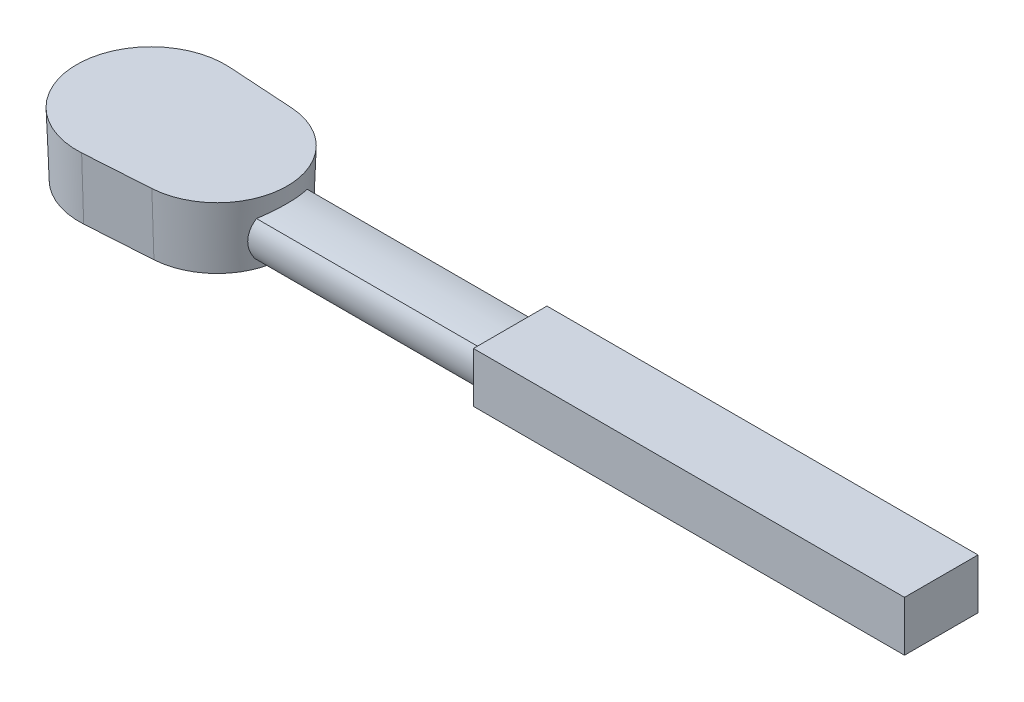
ISO-10303-21;
HEADER;
FILE_DESCRIPTION(('STEP AP214'),'2;1');
FILE_NAME('part.step','',(''),(''),'','','');
FILE_SCHEMA(('AUTOMOTIVE_DESIGN { 1 0 10303 214 1 1 1 1 }'));
ENDSEC;
DATA;
#1=APPLICATION_CONTEXT('core data for automotive mechanical design processes');
#2=APPLICATION_PROTOCOL_DEFINITION('international standard','automotive_design',2000,#1);
#3=PRODUCT_CONTEXT('',#1,'mechanical');
#4=PRODUCT('Part','Part','',(#3));
#5=PRODUCT_RELATED_PRODUCT_CATEGORY('part','',(#4));
#6=PRODUCT_DEFINITION_FORMATION('','',#4);
#7=PRODUCT_DEFINITION_CONTEXT('part definition',#1,'design');
#8=PRODUCT_DEFINITION('design','',#6,#7);
#9=PRODUCT_DEFINITION_SHAPE('','',#8);
#10=(LENGTH_UNIT() NAMED_UNIT(*) SI_UNIT(.MILLI.,.METRE.));
#11=(NAMED_UNIT(*) PLANE_ANGLE_UNIT() SI_UNIT($,.RADIAN.));
#12=(NAMED_UNIT(*) SI_UNIT($,.STERADIAN.) SOLID_ANGLE_UNIT());
#13=UNCERTAINTY_MEASURE_WITH_UNIT(LENGTH_MEASURE(1.E-05),#10,'distance_accuracy_value','');
#14=(GEOMETRIC_REPRESENTATION_CONTEXT(3) GLOBAL_UNCERTAINTY_ASSIGNED_CONTEXT((#13)) GLOBAL_UNIT_ASSIGNED_CONTEXT((#10,
#11,#12)) REPRESENTATION_CONTEXT('',''));
#15=CARTESIAN_POINT('',(0.,0.,0.));
#16=DIRECTION('',(0.,0.,1.));
#17=DIRECTION('',(1.,0.,0.));
#18=AXIS2_PLACEMENT_3D('',#15,#16,#17);
#19=CARTESIAN_POINT('',(46.8650318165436,0.,0.));
#20=DIRECTION('',(0.,1.,0.));
#21=DIRECTION('',(0.,0.,1.));
#22=AXIS2_PLACEMENT_3D('',#19,#20,#21);
#23=CONICAL_SURFACE('',#22,47.9487755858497,0.0349065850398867);
#24=CARTESIAN_POINT('',(46.8650318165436,0.,0.));
#25=DIRECTION('',(0.,1.,0.));
#26=DIRECTION('',(0.,0.,1.));
#27=AXIS2_PLACEMENT_3D('',#24,#25,#26);
#28=CIRCLE('',#27,47.9487755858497);
#29=CARTESIAN_POINT('',(49.9230325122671,0.,47.8511620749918));
#30=VERTEX_POINT('',#29);
#31=CARTESIAN_POINT('',(49.9230325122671,0.,-47.8511620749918));
#32=VERTEX_POINT('',#31);
#33=EDGE_CURVE('E186',#30,#32,#28,.T.);
#34=ORIENTED_EDGE('',*,*,#33,.T.);
#35=DIRECTION('',(0.00222576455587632,0.999390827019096,-0.0348284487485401));
#36=VECTOR('',#35,1.);
#37=CARTESIAN_POINT('',(49.9230325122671,0.,-47.8511620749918));
#38=LINE('',#37,#36);
#39=CARTESIAN_POINT('',(50.0220280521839,44.45,-49.4002302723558));
#40=VERTEX_POINT('',#39);
#41=EDGE_CURVE('E207',#40,#32,#38,.F.);
#42=ORIENTED_EDGE('',*,*,#41,.F.);
#43=CARTESIAN_POINT('',(46.8650318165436,44.45,0.));
#44=DIRECTION('',(0.,1.,0.));
#45=DIRECTION('',(0.,0.,1.));
#46=AXIS2_PLACEMENT_3D('',#43,#44,#45);
#47=CIRCLE('',#46,49.5010037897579);
#48=CARTESIAN_POINT('',(50.0220280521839,44.45,49.4002302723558));
#49=VERTEX_POINT('',#48);
#50=EDGE_CURVE('E195',#49,#40,#47,.T.);
#51=ORIENTED_EDGE('',*,*,#50,.F.);
#52=DIRECTION('',(0.00222576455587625,0.999390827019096,0.0348284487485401));
#53=VECTOR('',#52,1.);
#54=CARTESIAN_POINT('',(49.9230325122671,0.,47.8511620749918));
#55=LINE('',#54,#53);
#56=EDGE_CURVE('E204',#49,#30,#55,.F.);
#57=ORIENTED_EDGE('',*,*,#56,.T.);
#58=EDGE_LOOP('',(#34,#42,#51,#57));
#59=FACE_BOUND('',#58,.T.);
#60=CARTESIAN_POINT('',(92.5218864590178,31.5803299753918,-17.9306892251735));
#61=CARTESIAN_POINT('',(92.7446981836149,31.6948160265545,-17.3742988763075));
#62=CARTESIAN_POINT('',(92.9574742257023,31.8047525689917,-16.8129432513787));
#63=CARTESIAN_POINT('',(93.3624829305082,32.0149720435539,-15.6810533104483));
#64=CARTESIAN_POINT('',(93.5547144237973,32.1152544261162,-15.1105184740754));
#65=CARTESIAN_POINT('',(93.9181994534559,32.3056307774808,-13.9608865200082));
#66=CARTESIAN_POINT('',(94.0894457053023,32.3957212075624,-13.3817865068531));
#67=CARTESIAN_POINT('',(94.4104231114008,32.5651641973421,-12.2161530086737));
#68=CARTESIAN_POINT('',(94.560154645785,32.644516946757,-11.6296196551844));
#69=CARTESIAN_POINT('',(94.9762169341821,32.8656440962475,-9.86114318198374));
#70=CARTESIAN_POINT('',(95.2097884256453,32.990683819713,-8.66914567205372));
#71=CARTESIAN_POINT('',(95.5865391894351,33.1930091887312,-6.26726462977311));
#72=CARTESIAN_POINT('',(95.7297331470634,33.270302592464,-5.05738403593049));
#73=CARTESIAN_POINT('',(95.9243306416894,33.3754596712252,-2.62478852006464));
#74=CARTESIAN_POINT('',(95.9754868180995,33.4031901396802,-1.40204786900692));
#75=CARTESIAN_POINT('',(95.9845777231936,33.40811358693,1.04403805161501));
#76=CARTESIAN_POINT('',(95.9425005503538,33.3853001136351,2.26738337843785));
#77=CARTESIAN_POINT('',(95.7657482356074,33.2897487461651,4.70410999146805));
#78=CARTESIAN_POINT('',(95.6311657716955,33.2170608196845,5.91750002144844));
#79=CARTESIAN_POINT('',(95.2711852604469,33.0235914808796,8.32655869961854));
#80=CARTESIAN_POINT('',(95.0458162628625,32.9028254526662,9.52223288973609));
#81=CARTESIAN_POINT('',(94.635373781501,32.6844318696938,11.3243346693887));
#82=CARTESIAN_POINT('',(94.4822091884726,32.6031669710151,11.9402495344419));
#83=CARTESIAN_POINT('',(94.1522243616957,32.4287908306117,13.1639002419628));
#84=CARTESIAN_POINT('',(93.9754095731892,32.3356823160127,13.7716379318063));
#85=CARTESIAN_POINT('',(93.5989034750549,32.1383317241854,14.977094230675));
#86=CARTESIAN_POINT('',(93.3992473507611,32.034106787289,15.5748266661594));
#87=CARTESIAN_POINT('',(92.9773580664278,31.8150279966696,16.7604180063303));
#88=CARTESIAN_POINT('',(92.7551209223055,31.7001722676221,17.3482751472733));
#89=CARTESIAN_POINT('',(92.5218864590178,31.5803299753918,17.9306892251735));
#90=B_SPLINE_CURVE_WITH_KNOTS('',3,(#60,#61,#62,#63,#64,#65,#66,#67,#68,#69,#70,#71,#72,#73,#74,
#75,#76,#77,#78,#79,#80,#81,#82,#83,#84,#85,#86,#87,#88,#89),.UNSPECIFIED.,.F.,.F.,(4,2,2,2,2,2,
2,2,2,2,2,2,2,2,4),(0.,1.83043841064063,3.66098095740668,5.49215714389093,7.32330097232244,
10.9818467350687,14.639797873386,18.3075655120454,21.9758013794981,25.6403675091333,
29.3037619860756,31.2228268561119,33.141450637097,35.0571577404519,36.9732034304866),.UNSPECIFIED.);
#91=CARTESIAN_POINT('',(92.5219665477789,31.5803711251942,-17.9304892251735));
#92=VERTEX_POINT('',#91);
#93=CARTESIAN_POINT('',(92.5219665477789,31.5803711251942,17.9304892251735));
#94=VERTEX_POINT('',#93);
#95=EDGE_CURVE('E11',#92,#94,#90,.T.);
#96=ORIENTED_EDGE('',*,*,#95,.F.);
#97=CARTESIAN_POINT('',(91.580486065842,6.51942887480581,-17.9303494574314));
#98=CARTESIAN_POINT('',(91.4664358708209,6.98942211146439,-18.2588415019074));
#99=CARTESIAN_POINT('',(91.3561137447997,7.47304459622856,-18.5692745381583));
#100=CARTESIAN_POINT('',(91.1460914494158,8.46515507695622,-19.1521409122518));
#101=CARTESIAN_POINT('',(91.046396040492,8.97365406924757,-19.4245572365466));
#102=CARTESIAN_POINT('',(90.8606486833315,10.014111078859,-19.9298968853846));
#103=CARTESIAN_POINT('',(90.7746345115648,10.5461290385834,-20.1627109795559));
#104=CARTESIAN_POINT('',(90.6196124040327,11.6291094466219,-20.5859398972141));
#105=CARTESIAN_POINT('',(90.5506019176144,12.1800690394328,-20.7763610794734));
#106=CARTESIAN_POINT('',(90.4320478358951,13.2992677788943,-21.1136071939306));
#107=CARTESIAN_POINT('',(90.3825695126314,13.8675581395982,-21.2602855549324));
#108=CARTESIAN_POINT('',(90.3055666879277,15.0155683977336,-21.5076910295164));
#109=CARTESIAN_POINT('',(90.2780430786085,15.5952887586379,-21.6084162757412));
#110=CARTESIAN_POINT('',(90.2464355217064,16.7603022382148,-21.7626840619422));
#111=CARTESIAN_POINT('',(90.2422994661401,17.3455800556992,-21.8163312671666));
#112=CARTESIAN_POINT('',(90.2579281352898,18.5182123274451,-21.8763449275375));
#113=CARTESIAN_POINT('',(90.2776914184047,19.1055666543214,-21.8827142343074));
#114=CARTESIAN_POINT('',(90.3390752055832,20.2452787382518,-21.8492763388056));
#115=CARTESIAN_POINT('',(90.379431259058,20.7977814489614,-21.811994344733));
#116=CARTESIAN_POINT('',(90.4802558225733,21.8965421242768,-21.6959677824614));
#117=CARTESIAN_POINT('',(90.540724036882,22.4428001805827,-21.6172238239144));
#118=CARTESIAN_POINT('',(90.6803623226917,23.5265449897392,-21.4190862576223));
#119=CARTESIAN_POINT('',(90.7595684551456,24.0640126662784,-21.299614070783));
#120=CARTESIAN_POINT('',(90.9345876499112,25.1258666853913,-21.021363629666));
#121=CARTESIAN_POINT('',(91.0304001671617,25.6502534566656,-20.8625866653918));
#122=CARTESIAN_POINT('',(91.2300029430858,26.6517461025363,-20.5180232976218));
#123=CARTESIAN_POINT('',(91.3329549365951,27.129788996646,-20.3344637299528));
#124=CARTESIAN_POINT('',(91.5492849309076,28.0698630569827,-19.9352826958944));
#125=CARTESIAN_POINT('',(91.6626632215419,28.5318937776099,-19.719660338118));
#126=CARTESIAN_POINT('',(91.8971598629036,29.436372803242,-19.2585715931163));
#127=CARTESIAN_POINT('',(92.0182465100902,29.8788900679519,-19.0132241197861));
#128=CARTESIAN_POINT('',(92.2662889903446,30.744588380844,-18.4933552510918));
#129=CARTESIAN_POINT('',(92.3932434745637,31.1677738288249,-18.218840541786));
#130=CARTESIAN_POINT('',(92.5220289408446,31.5805711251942,-17.9303494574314));
#131=B_SPLINE_CURVE_WITH_KNOTS('',3,(#97,#98,#99,#100,#101,#102,#103,#104,#105,#106,#107,#108,
#109,#110,#111,#112,#113,#114,#115,#116,#117,#118,#119,#120,#121,#122,#123,#124,#125,#126,#127,
#128,#129,#130),.UNSPECIFIED.,.F.,.F.,(4,2,2,2,2,2,2,2,2,2,2,2,2,2,2,2,4),(0.,1.75361022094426,
3.50800273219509,5.26715836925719,7.02604996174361,8.79077059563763,10.5555629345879,
12.3164217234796,14.0771743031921,15.7409009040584,17.4046030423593,19.0715333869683,
20.7384090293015,22.3040206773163,23.8696758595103,25.4292626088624,26.9884926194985),.UNSPECIFIED.);
#132=CARTESIAN_POINT('',(91.580437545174,6.5196288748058,-17.9304892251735));
#133=VERTEX_POINT('',#132);
#134=EDGE_CURVE('E203',#133,#92,#131,.T.);
#135=ORIENTED_EDGE('',*,*,#134,.F.);
#136=CARTESIAN_POINT('',(91.5803588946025,6.51967002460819,17.9306892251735));
#137=CARTESIAN_POINT('',(91.8024305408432,6.4034773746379,17.3660063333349));
#138=CARTESIAN_POINT('',(92.0143136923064,6.2919975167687,16.7963372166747));
#139=CARTESIAN_POINT('',(92.4172451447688,6.07902564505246,15.6478037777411));
#140=CARTESIAN_POINT('',(92.6082923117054,5.97753417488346,15.0689389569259));
#141=CARTESIAN_POINT('',(92.9691291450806,5.78508238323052,13.9026607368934));
#142=CARTESIAN_POINT('',(93.1389117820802,5.69412554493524,13.3152445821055));
#143=CARTESIAN_POINT('',(93.4567013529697,5.5232952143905,12.1330096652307));
#144=CARTESIAN_POINT('',(93.6047086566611,5.44342153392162,11.5381910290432));
#145=CARTESIAN_POINT('',(94.0152625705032,5.22123771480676,9.74481734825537));
#146=CARTESIAN_POINT('',(94.2446709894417,5.09618795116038,8.53628012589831));
#147=CARTESIAN_POINT('',(94.6122071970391,4.89523261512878,6.10168674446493));
#148=CARTESIAN_POINT('',(94.750349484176,4.81931923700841,4.87563339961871));
#149=CARTESIAN_POINT('',(94.9340322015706,4.71827987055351,2.41130284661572));
#150=CARTESIAN_POINT('',(94.9793346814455,4.69328438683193,1.17300238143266));
#151=CARTESIAN_POINT('',(94.9760410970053,4.69509967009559,-1.30359860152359));
#152=CARTESIAN_POINT('',(94.9274326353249,4.72191727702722,-2.54189909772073));
#153=CARTESIAN_POINT('',(94.7370245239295,4.82664112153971,-5.00769563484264));
#154=CARTESIAN_POINT('',(94.5953277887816,4.90449093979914,-6.23520209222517));
#155=CARTESIAN_POINT('',(94.2205662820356,5.1093347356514,-8.67172178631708));
#156=CARTESIAN_POINT('',(93.9875326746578,5.2363119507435,-9.88074118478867));
#157=CARTESIAN_POINT('',(93.5741665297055,5.45991184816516,-11.6630037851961));
#158=CARTESIAN_POINT('',(93.4274233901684,5.5390663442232,-12.2464952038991));
#159=CARTESIAN_POINT('',(93.1130129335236,5.70800877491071,-13.4061474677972));
#160=CARTESIAN_POINT('',(92.9453505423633,5.79779420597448,-13.9823100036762));
#161=CARTESIAN_POINT('',(92.5897687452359,5.98738038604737,-15.1256651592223));
#162=CARTESIAN_POINT('',(92.4018809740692,6.08716547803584,-15.6928702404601));
#163=CARTESIAN_POINT('',(92.00604879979,6.29634596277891,-16.818545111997));
#164=CARTESIAN_POINT('',(91.7981012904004,6.4057428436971,-17.3770135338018));
#165=CARTESIAN_POINT('',(91.5803588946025,6.51967002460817,-17.9306892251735));
#166=B_SPLINE_CURVE_WITH_KNOTS('',3,(#136,#137,#138,#139,#140,#141,#142,#143,#144,#145,#146,
#147,#148,#149,#150,#151,#152,#153,#154,#155,#156,#157,#158,#159,#160,#161,#162,#163,#164,#165),
.UNSPECIFIED.,.F.,.F.,(4,2,2,2,2,2,2,2,2,2,2,2,2,2,4),(0.,1.85330428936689,3.70670940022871,
5.5607255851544,7.41471028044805,11.1193053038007,14.8233116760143,18.5367996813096,
22.2507779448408,25.9606570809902,29.6692715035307,31.4894042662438,33.3091092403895,
35.1260082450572,36.9431890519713),.UNSPECIFIED.);
#167=CARTESIAN_POINT('',(91.580437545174,6.51962887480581,17.9304892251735));
#168=VERTEX_POINT('',#167);
#169=EDGE_CURVE('E48',#168,#133,#166,.T.);
#170=ORIENTED_EDGE('',*,*,#169,.F.);
#171=CARTESIAN_POINT('',(92.5220289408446,31.5805711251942,17.9303494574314));
#172=CARTESIAN_POINT('',(92.3724548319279,31.1011614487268,18.2654024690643));
#173=CARTESIAN_POINT('',(92.2253521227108,30.6077132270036,18.5816089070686));
#174=CARTESIAN_POINT('',(91.9395171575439,29.5949798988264,19.174470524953));
#175=CARTESIAN_POINT('',(91.8007888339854,29.0756828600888,19.4511072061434));
#176=CARTESIAN_POINT('',(91.5347193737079,28.0117168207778,19.9637280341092));
#177=CARTESIAN_POINT('',(91.4074284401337,27.4669505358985,20.1995368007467));
#178=CARTESIAN_POINT('',(91.1683589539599,26.3571156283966,20.6269781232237));
#179=CARTESIAN_POINT('',(91.0565781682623,25.7920499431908,20.8186170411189));
#180=CARTESIAN_POINT('',(90.8513690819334,24.6429554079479,21.1563543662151));
#181=CARTESIAN_POINT('',(90.7580065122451,24.0588670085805,21.3022907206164));
#182=CARTESIAN_POINT('',(90.5929650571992,22.8776365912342,21.5458922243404));
#183=CARTESIAN_POINT('',(90.5212869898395,22.2804940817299,21.6435555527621));
#184=CARTESIAN_POINT('',(90.4019952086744,21.0793893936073,21.7889691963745));
#185=CARTESIAN_POINT('',(90.3543178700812,20.4754496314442,21.8368518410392));
#186=CARTESIAN_POINT('',(90.2841230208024,19.2642448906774,21.8822741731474));
#187=CARTESIAN_POINT('',(90.2616032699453,18.6569802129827,21.8798183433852));
#188=CARTESIAN_POINT('',(90.2428114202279,17.4876632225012,21.8263485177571));
#189=CARTESIAN_POINT('',(90.2447812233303,16.9254764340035,21.7788115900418));
#190=CARTESIAN_POINT('',(90.2702864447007,15.8069431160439,21.6405349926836));
#191=CARTESIAN_POINT('',(90.2938215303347,15.2505964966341,21.5497959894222));
#192=CARTESIAN_POINT('',(90.3613335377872,14.1468333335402,21.3257897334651));
#193=CARTESIAN_POINT('',(90.4053452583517,13.5994336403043,21.1924502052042));
#194=CARTESIAN_POINT('',(90.5120101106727,12.5182669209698,20.8845634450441));
#195=CARTESIAN_POINT('',(90.5746616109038,11.9844987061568,20.7100198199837));
#196=CARTESIAN_POINT('',(90.704852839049,11.0187873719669,20.3527121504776));
#197=CARTESIAN_POINT('',(90.769968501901,10.5843228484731,20.1758295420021));
#198=CARTESIAN_POINT('',(90.9101426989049,9.7289694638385,19.7952050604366));
#199=CARTESIAN_POINT('',(90.9852012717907,9.30808065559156,19.5914630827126));
#200=CARTESIAN_POINT('',(91.1433238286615,8.48294284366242,19.1589698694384));
#201=CARTESIAN_POINT('',(91.2263577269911,8.07863892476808,18.9303122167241));
#202=CARTESIAN_POINT('',(91.3989511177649,7.28642214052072,18.4484669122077));
#203=CARTESIAN_POINT('',(91.4885099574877,6.89850764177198,18.1952817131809));
#204=CARTESIAN_POINT('',(91.580486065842,6.51942887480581,17.9303494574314));
#205=B_SPLINE_CURVE_WITH_KNOTS('',3,(#171,#172,#173,#174,#175,#176,#177,#178,#179,#180,#181,
#182,#183,#184,#185,#186,#187,#188,#189,#190,#191,#192,#193,#194,#195,#196,#197,#198,#199,#200,
#201,#202,#203,#204),.UNSPECIFIED.,.F.,.F.,(4,2,2,2,2,2,2,2,2,2,2,2,2,2,2,2,4),(0.,
1.81078883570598,3.6224214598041,5.44165280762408,7.26062195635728,9.08596965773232,
10.9113862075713,12.7319378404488,14.5523273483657,16.2428342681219,17.933315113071,
19.6266793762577,21.3198954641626,22.7396218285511,24.159353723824,25.5739258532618,
26.9883566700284),.UNSPECIFIED.);
#206=EDGE_CURVE('E38',#94,#168,#205,.T.);
#207=ORIENTED_EDGE('',*,*,#206,.F.);
#208=EDGE_LOOP('',(#96,#135,#170,#207));
#209=FACE_BOUND('',#208,.T.);
#210=ADVANCED_FACE('F26',(#59,#209),#23,.T.);
#211=CARTESIAN_POINT('',(0.,0.,0.));
#212=DIRECTION('',(0.,1.,0.));
#213=DIRECTION('',(0.,0.,1.));
#214=AXIS2_PLACEMENT_3D('',#211,#212,#213);
#215=CONICAL_SURFACE('',#214,50.9376589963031,0.0349065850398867);
#216=CARTESIAN_POINT('',(0.,0.,0.));
#217=DIRECTION('',(0.,1.,0.));
#218=DIRECTION('',(0.,0.,1.));
#219=AXIS2_PLACEMENT_3D('',#216,#217,#218);
#220=CIRCLE('',#219,50.9376589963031);
#221=CARTESIAN_POINT('',(3.24862094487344,0.,-50.8339607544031));
#222=VERTEX_POINT('',#221);
#223=CARTESIAN_POINT('',(3.24862094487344,0.,50.8339607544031));
#224=VERTEX_POINT('',#223);
#225=EDGE_CURVE('E181',#222,#224,#220,.T.);
#226=ORIENTED_EDGE('',*,*,#225,.T.);
#227=DIRECTION('',(0.00222576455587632,0.999390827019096,0.0348284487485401));
#228=VECTOR('',#227,1.);
#229=CARTESIAN_POINT('',(3.24862094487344,0.,50.8339607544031));
#230=LINE('',#229,#228);
#231=CARTESIAN_POINT('',(3.34761648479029,44.45,52.3830289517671));
#232=VERTEX_POINT('',#231);
#233=EDGE_CURVE('E200',#232,#224,#230,.F.);
#234=ORIENTED_EDGE('',*,*,#233,.F.);
#235=CARTESIAN_POINT('',(0.,44.45,0.));
#236=DIRECTION('',(0.,1.,0.));
#237=DIRECTION('',(0.,0.,1.));
#238=AXIS2_PLACEMENT_3D('',#235,#236,#237);
#239=CIRCLE('',#238,52.4898872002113);
#240=CARTESIAN_POINT('',(3.34761648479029,44.45,-52.3830289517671));
#241=VERTEX_POINT('',#240);
#242=EDGE_CURVE('E190',#241,#232,#239,.T.);
#243=ORIENTED_EDGE('',*,*,#242,.F.);
#244=DIRECTION('',(0.00222576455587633,0.999390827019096,-0.0348284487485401));
#245=VECTOR('',#244,1.);
#246=CARTESIAN_POINT('',(3.24862094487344,0.,-50.8339607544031));
#247=LINE('',#246,#245);
#248=EDGE_CURVE('E199',#241,#222,#247,.F.);
#249=ORIENTED_EDGE('',*,*,#248,.T.);
#250=EDGE_LOOP('',(#226,#234,#243,#249));
#251=FACE_BOUND('',#250,.T.);
#252=ADVANCED_FACE('F251',(#251),#215,.T.);
#253=CARTESIAN_POINT('',(3.24862094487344,0.,50.8339607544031));
#254=DIRECTION('',(0.0637375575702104,-0.034899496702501,0.997356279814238));
#255=DIRECTION('',(0.997964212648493,0.,-0.0637764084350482));
#256=AXIS2_PLACEMENT_3D('',#253,#254,#255);
#257=PLANE('',#256);
#258=DIRECTION('',(0.997964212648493,0.,-0.0637764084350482));
#259=VECTOR('',#258,1.);
#260=CARTESIAN_POINT('',(3.24862094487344,0.,50.8339607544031));
#261=LINE('',#260,#259);
#262=EDGE_CURVE('E184',#224,#30,#261,.T.);
#263=ORIENTED_EDGE('',*,*,#262,.T.);
#264=ORIENTED_EDGE('',*,*,#56,.F.);
#265=DIRECTION('',(-0.997964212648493,0.,0.0637764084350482));
#266=VECTOR('',#265,1.);
#267=CARTESIAN_POINT('',(3.34761648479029,44.45,52.3830289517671));
#268=LINE('',#267,#266);
#269=EDGE_CURVE('E193',#232,#49,#268,.F.);
#270=ORIENTED_EDGE('',*,*,#269,.F.);
#271=ORIENTED_EDGE('',*,*,#233,.T.);
#272=EDGE_LOOP('',(#263,#264,#270,#271));
#273=FACE_BOUND('',#272,.T.);
#274=ADVANCED_FACE('F28',(#273),#257,.T.);
#275=CARTESIAN_POINT('',(3.24862094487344,0.,-50.8339607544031));
#276=DIRECTION('',(0.0637375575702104,-0.034899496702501,-0.997356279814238));
#277=DIRECTION('',(-0.997964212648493,0.,-0.0637764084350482));
#278=AXIS2_PLACEMENT_3D('',#275,#276,#277);
#279=PLANE('',#278);
#280=DIRECTION('',(-0.997964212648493,0.,-0.0637764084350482));
#281=VECTOR('',#280,1.);
#282=CARTESIAN_POINT('',(3.24862094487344,0.,-50.8339607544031));
#283=LINE('',#282,#281);
#284=EDGE_CURVE('E188',#32,#222,#283,.T.);
#285=ORIENTED_EDGE('',*,*,#284,.T.);
#286=ORIENTED_EDGE('',*,*,#248,.F.);
#287=DIRECTION('',(0.997964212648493,0.,0.0637764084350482));
#288=VECTOR('',#287,1.);
#289=CARTESIAN_POINT('',(3.34761648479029,44.45,-52.3830289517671));
#290=LINE('',#289,#288);
#291=EDGE_CURVE('E197',#40,#241,#290,.F.);
#292=ORIENTED_EDGE('',*,*,#291,.F.);
#293=ORIENTED_EDGE('',*,*,#41,.T.);
#294=EDGE_LOOP('',(#285,#286,#292,#293));
#295=FACE_BOUND('',#294,.T.);
#296=ADVANCED_FACE('F268',(#295),#279,.T.);
#297=CARTESIAN_POINT('',(0.,44.45,0.));
#298=DIRECTION('',(0.,1.,0.));
#299=DIRECTION('',(0.,0.,1.));
#300=AXIS2_PLACEMENT_3D('',#297,#298,#299);
#301=PLANE('',#300);
#302=ORIENTED_EDGE('',*,*,#242,.T.);
#303=ORIENTED_EDGE('',*,*,#269,.T.);
#304=ORIENTED_EDGE('',*,*,#50,.T.);
#305=ORIENTED_EDGE('',*,*,#291,.T.);
#306=EDGE_LOOP('',(#302,#303,#304,#305));
#307=FACE_BOUND('',#306,.T.);
#308=ADVANCED_FACE('F275',(#307),#301,.T.);
#309=CARTESIAN_POINT('',(0.,0.,0.));
#310=DIRECTION('',(0.,1.,0.));
#311=DIRECTION('',(0.,0.,1.));
#312=AXIS2_PLACEMENT_3D('',#309,#310,#311);
#313=PLANE('',#312);
#314=ORIENTED_EDGE('',*,*,#225,.F.);
#315=ORIENTED_EDGE('',*,*,#284,.F.);
#316=ORIENTED_EDGE('',*,*,#33,.F.);
#317=ORIENTED_EDGE('',*,*,#262,.F.);
#318=EDGE_LOOP('',(#314,#315,#316,#317));
#319=FACE_BOUND('',#318,.T.);
#320=ADVANCED_FACE('F271',(#319),#313,.F.);
#321=CARTESIAN_POINT('',(254.,-55.5675247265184,0.));
#322=DIRECTION('',(-1.,0.,0.));
#323=DIRECTION('',(0.,0.,1.));
#324=AXIS2_PLACEMENT_3D('',#321,#322,#323);
#325=CYLINDRICAL_SURFACE('',#324,88.9733566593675);
#326=DIRECTION('',(-1.,0.,0.));
#327=VECTOR('',#326,1.);
#328=CARTESIAN_POINT('',(254.,31.5803711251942,-17.9304892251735));
#329=LINE('',#328,#327);
#330=CARTESIAN_POINT('',(254.,31.5803711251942,-17.9304892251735));
#331=VERTEX_POINT('',#330);
#332=EDGE_CURVE('E169',#331,#92,#329,.T.);
#333=ORIENTED_EDGE('',*,*,#332,.T.);
#334=ORIENTED_EDGE('',*,*,#95,.T.);
#335=DIRECTION('',(-1.,0.,0.));
#336=VECTOR('',#335,1.);
#337=CARTESIAN_POINT('',(254.,31.5803711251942,17.9304892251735));
#338=LINE('',#337,#336);
#339=CARTESIAN_POINT('',(254.,31.5803711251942,17.9304892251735));
#340=VERTEX_POINT('',#339);
#341=EDGE_CURVE('E178',#340,#94,#338,.T.);
#342=ORIENTED_EDGE('',*,*,#341,.F.);
#343=CARTESIAN_POINT('',(254.,-55.5675247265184,0.));
#344=DIRECTION('',(1.,0.,0.));
#345=DIRECTION('',(0.,0.,1.));
#346=AXIS2_PLACEMENT_3D('',#343,#344,#345);
#347=CIRCLE('',#346,88.9733566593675);
#348=EDGE_CURVE('E134',#331,#340,#347,.T.);
#349=ORIENTED_EDGE('',*,*,#348,.F.);
#350=EDGE_LOOP('',(#333,#334,#342,#349));
#351=FACE_BOUND('',#350,.T.);
#352=ADVANCED_FACE('F238',(#351),#325,.T.);
#353=CARTESIAN_POINT('',(254.,19.05,0.));
#354=DIRECTION('',(-1.,0.,0.));
#355=DIRECTION('',(0.,0.,1.));
#356=AXIS2_PLACEMENT_3D('',#353,#354,#355);
#357=CYLINDRICAL_SURFACE('',#356,21.8749318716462);
#358=ORIENTED_EDGE('',*,*,#341,.T.);
#359=ORIENTED_EDGE('',*,*,#206,.T.);
#360=DIRECTION('',(-1.,0.,0.));
#361=VECTOR('',#360,1.);
#362=CARTESIAN_POINT('',(254.,6.51962887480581,17.9304892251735));
#363=LINE('',#362,#361);
#364=CARTESIAN_POINT('',(254.,6.51962887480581,17.9304892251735));
#365=VERTEX_POINT('',#364);
#366=EDGE_CURVE('E175',#365,#168,#363,.T.);
#367=ORIENTED_EDGE('',*,*,#366,.F.);
#368=CARTESIAN_POINT('',(254.,19.05,0.));
#369=DIRECTION('',(1.,0.,0.));
#370=DIRECTION('',(0.,0.,-1.));
#371=AXIS2_PLACEMENT_3D('',#368,#369,#370);
#372=CIRCLE('',#371,21.8749318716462);
#373=EDGE_CURVE('E160',#340,#365,#372,.T.);
#374=ORIENTED_EDGE('',*,*,#373,.F.);
#375=EDGE_LOOP('',(#358,#359,#367,#374));
#376=FACE_BOUND('',#375,.T.);
#377=ADVANCED_FACE('F234',(#376),#357,.T.);
#378=CARTESIAN_POINT('',(254.,93.6675247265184,0.));
#379=DIRECTION('',(-1.,0.,0.));
#380=DIRECTION('',(0.,0.,1.));
#381=AXIS2_PLACEMENT_3D('',#378,#379,#380);
#382=CYLINDRICAL_SURFACE('',#381,88.9733566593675);
#383=ORIENTED_EDGE('',*,*,#366,.T.);
#384=ORIENTED_EDGE('',*,*,#169,.T.);
#385=DIRECTION('',(-1.,0.,0.));
#386=VECTOR('',#385,1.);
#387=CARTESIAN_POINT('',(254.,6.51962887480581,-17.9304892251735));
#388=LINE('',#387,#386);
#389=CARTESIAN_POINT('',(254.,6.51962887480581,-17.9304892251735));
#390=VERTEX_POINT('',#389);
#391=EDGE_CURVE('E172',#390,#133,#388,.T.);
#392=ORIENTED_EDGE('',*,*,#391,.F.);
#393=CARTESIAN_POINT('',(254.,93.6675247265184,0.));
#394=DIRECTION('',(1.,0.,0.));
#395=DIRECTION('',(0.,0.,-1.));
#396=AXIS2_PLACEMENT_3D('',#393,#394,#395);
#397=CIRCLE('',#396,88.9733566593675);
#398=EDGE_CURVE('E163',#365,#390,#397,.T.);
#399=ORIENTED_EDGE('',*,*,#398,.F.);
#400=EDGE_LOOP('',(#383,#384,#392,#399));
#401=FACE_BOUND('',#400,.T.);
#402=ADVANCED_FACE('F228',(#401),#382,.T.);
#403=CARTESIAN_POINT('',(254.,19.05,0.));
#404=DIRECTION('',(-1.,0.,0.));
#405=DIRECTION('',(0.,0.,1.));
#406=AXIS2_PLACEMENT_3D('',#403,#404,#405);
#407=CYLINDRICAL_SURFACE('',#406,21.8749318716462);
#408=ORIENTED_EDGE('',*,*,#391,.T.);
#409=ORIENTED_EDGE('',*,*,#134,.T.);
#410=ORIENTED_EDGE('',*,*,#332,.F.);
#411=CARTESIAN_POINT('',(254.,19.05,0.));
#412=DIRECTION('',(1.,0.,0.));
#413=DIRECTION('',(0.,0.,-1.));
#414=AXIS2_PLACEMENT_3D('',#411,#412,#413);
#415=CIRCLE('',#414,21.8749318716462);
#416=EDGE_CURVE('E166',#390,#331,#415,.T.);
#417=ORIENTED_EDGE('',*,*,#416,.F.);
#418=EDGE_LOOP('',(#408,#409,#410,#417));
#419=FACE_BOUND('',#418,.T.);
#420=ADVANCED_FACE('F224',(#419),#407,.T.);
#421=CARTESIAN_POINT('',(254.,1.31685435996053,25.9873125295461));
#422=DIRECTION('',(1.,0.,0.));
#423=DIRECTION('',(0.,0.,-1.));
#424=AXIS2_PLACEMENT_3D('',#421,#422,#423);
#425=PLANE('',#424);
#426=DIRECTION('',(0.,-1.,0.));
#427=VECTOR('',#426,1.);
#428=CARTESIAN_POINT('',(254.,36.7831456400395,25.9873125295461));
#429=LINE('',#428,#427);
#430=CARTESIAN_POINT('',(254.,36.7831456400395,25.9873125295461));
#431=VERTEX_POINT('',#430);
#432=CARTESIAN_POINT('',(254.,1.31685435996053,25.9873125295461));
#433=VERTEX_POINT('',#432);
#434=EDGE_CURVE('E121',#431,#433,#429,.T.);
#435=ORIENTED_EDGE('',*,*,#434,.F.);
#436=DIRECTION('',(0.,0.,1.));
#437=VECTOR('',#436,1.);
#438=CARTESIAN_POINT('',(254.,36.7831456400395,25.9873125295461));
#439=LINE('',#438,#437);
#440=CARTESIAN_POINT('',(254.,36.7831456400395,-25.9873125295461));
#441=VERTEX_POINT('',#440);
#442=EDGE_CURVE('E144',#441,#431,#439,.T.);
#443=ORIENTED_EDGE('',*,*,#442,.F.);
#444=DIRECTION('',(0.,1.,0.));
#445=VECTOR('',#444,1.);
#446=CARTESIAN_POINT('',(254.,36.7831456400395,-25.9873125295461));
#447=LINE('',#446,#445);
#448=CARTESIAN_POINT('',(254.,1.31685435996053,-25.9873125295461));
#449=VERTEX_POINT('',#448);
#450=EDGE_CURVE('E122',#449,#441,#447,.T.);
#451=ORIENTED_EDGE('',*,*,#450,.F.);
#452=DIRECTION('',(0.,0.,-1.));
#453=VECTOR('',#452,1.);
#454=CARTESIAN_POINT('',(254.,1.31685435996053,25.9873125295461));
#455=LINE('',#454,#453);
#456=EDGE_CURVE('E115',#433,#449,#455,.T.);
#457=ORIENTED_EDGE('',*,*,#456,.F.);
#458=EDGE_LOOP('',(#435,#443,#451,#457));
#459=FACE_BOUND('',#458,.T.);
#460=ORIENTED_EDGE('',*,*,#416,.T.);
#461=ORIENTED_EDGE('',*,*,#348,.T.);
#462=ORIENTED_EDGE('',*,*,#373,.T.);
#463=ORIENTED_EDGE('',*,*,#398,.T.);
#464=EDGE_LOOP('',(#460,#461,#462,#463));
#465=FACE_BOUND('',#464,.T.);
#466=ADVANCED_FACE('F117',(#459,#465),#425,.F.);
#467=CARTESIAN_POINT('',(558.8,36.7831456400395,25.9873125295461));
#468=DIRECTION('',(0.,0.,-1.));
#469=DIRECTION('',(-1.,0.,0.));
#470=AXIS2_PLACEMENT_3D('',#467,#468,#469);
#471=PLANE('',#470);
#472=ORIENTED_EDGE('',*,*,#434,.T.);
#473=DIRECTION('',(-1.,0.,0.));
#474=VECTOR('',#473,1.);
#475=CARTESIAN_POINT('',(558.8,1.31685435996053,25.9873125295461));
#476=LINE('',#475,#474);
#477=CARTESIAN_POINT('',(558.8,1.31685435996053,25.9873125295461));
#478=VERTEX_POINT('',#477);
#479=EDGE_CURVE('E128',#478,#433,#476,.T.);
#480=ORIENTED_EDGE('',*,*,#479,.F.);
#481=DIRECTION('',(0.,-1.,0.));
#482=VECTOR('',#481,1.);
#483=CARTESIAN_POINT('',(558.8,36.7831456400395,25.9873125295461));
#484=LINE('',#483,#482);
#485=CARTESIAN_POINT('',(558.8,36.7831456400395,25.9873125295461));
#486=VERTEX_POINT('',#485);
#487=EDGE_CURVE('E146',#486,#478,#484,.T.);
#488=ORIENTED_EDGE('',*,*,#487,.F.);
#489=DIRECTION('',(-1.,0.,0.));
#490=VECTOR('',#489,1.);
#491=CARTESIAN_POINT('',(558.8,36.7831456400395,25.9873125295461));
#492=LINE('',#491,#490);
#493=EDGE_CURVE('E140',#486,#431,#492,.T.);
#494=ORIENTED_EDGE('',*,*,#493,.T.);
#495=EDGE_LOOP('',(#472,#480,#488,#494));
#496=FACE_BOUND('',#495,.T.);
#497=ADVANCED_FACE('F138',(#496),#471,.F.);
#498=CARTESIAN_POINT('',(558.8,1.31685435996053,25.9873125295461));
#499=DIRECTION('',(0.,1.,0.));
#500=DIRECTION('',(0.,0.,1.));
#501=AXIS2_PLACEMENT_3D('',#498,#499,#500);
#502=PLANE('',#501);
#503=ORIENTED_EDGE('',*,*,#456,.T.);
#504=DIRECTION('',(-1.,0.,0.));
#505=VECTOR('',#504,1.);
#506=CARTESIAN_POINT('',(558.8,1.31685435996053,-25.9873125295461));
#507=LINE('',#506,#505);
#508=CARTESIAN_POINT('',(558.8,1.31685435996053,-25.9873125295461));
#509=VERTEX_POINT('',#508);
#510=EDGE_CURVE('E135',#509,#449,#507,.T.);
#511=ORIENTED_EDGE('',*,*,#510,.F.);
#512=DIRECTION('',(0.,0.,-1.));
#513=VECTOR('',#512,1.);
#514=CARTESIAN_POINT('',(558.8,1.31685435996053,25.9873125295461));
#515=LINE('',#514,#513);
#516=EDGE_CURVE('E130',#478,#509,#515,.T.);
#517=ORIENTED_EDGE('',*,*,#516,.F.);
#518=ORIENTED_EDGE('',*,*,#479,.T.);
#519=EDGE_LOOP('',(#503,#511,#517,#518));
#520=FACE_BOUND('',#519,.T.);
#521=ADVANCED_FACE('F129',(#520),#502,.F.);
#522=CARTESIAN_POINT('',(558.8,36.7831456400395,-25.9873125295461));
#523=DIRECTION('',(0.,0.,1.));
#524=DIRECTION('',(1.,0.,0.));
#525=AXIS2_PLACEMENT_3D('',#522,#523,#524);
#526=PLANE('',#525);
#527=ORIENTED_EDGE('',*,*,#450,.T.);
#528=DIRECTION('',(-1.,0.,0.));
#529=VECTOR('',#528,1.);
#530=CARTESIAN_POINT('',(558.8,36.7831456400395,-25.9873125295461));
#531=LINE('',#530,#529);
#532=CARTESIAN_POINT('',(558.8,36.7831456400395,-25.9873125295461));
#533=VERTEX_POINT('',#532);
#534=EDGE_CURVE('E154',#533,#441,#531,.T.);
#535=ORIENTED_EDGE('',*,*,#534,.F.);
#536=DIRECTION('',(0.,1.,0.));
#537=VECTOR('',#536,1.);
#538=CARTESIAN_POINT('',(558.8,36.7831456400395,-25.9873125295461));
#539=LINE('',#538,#537);
#540=EDGE_CURVE('E149',#509,#533,#539,.T.);
#541=ORIENTED_EDGE('',*,*,#540,.F.);
#542=ORIENTED_EDGE('',*,*,#510,.T.);
#543=EDGE_LOOP('',(#527,#535,#541,#542));
#544=FACE_BOUND('',#543,.T.);
#545=ADVANCED_FACE('F318',(#544),#526,.F.);
#546=CARTESIAN_POINT('',(558.8,36.7831456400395,25.9873125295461));
#547=DIRECTION('',(0.,-1.,0.));
#548=DIRECTION('',(0.,0.,-1.));
#549=AXIS2_PLACEMENT_3D('',#546,#547,#548);
#550=PLANE('',#549);
#551=ORIENTED_EDGE('',*,*,#442,.T.);
#552=ORIENTED_EDGE('',*,*,#493,.F.);
#553=DIRECTION('',(0.,0.,1.));
#554=VECTOR('',#553,1.);
#555=CARTESIAN_POINT('',(558.8,36.7831456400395,25.9873125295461));
#556=LINE('',#555,#554);
#557=EDGE_CURVE('E151',#533,#486,#556,.T.);
#558=ORIENTED_EDGE('',*,*,#557,.F.);
#559=ORIENTED_EDGE('',*,*,#534,.T.);
#560=EDGE_LOOP('',(#551,#552,#558,#559));
#561=FACE_BOUND('',#560,.T.);
#562=ADVANCED_FACE('F324',(#561),#550,.F.);
#563=CARTESIAN_POINT('',(558.8,1.31685435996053,25.9873125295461));
#564=DIRECTION('',(1.,0.,0.));
#565=DIRECTION('',(0.,0.,-1.));
#566=AXIS2_PLACEMENT_3D('',#563,#564,#565);
#567=PLANE('',#566);
#568=ORIENTED_EDGE('',*,*,#487,.T.);
#569=ORIENTED_EDGE('',*,*,#516,.T.);
#570=ORIENTED_EDGE('',*,*,#540,.T.);
#571=ORIENTED_EDGE('',*,*,#557,.T.);
#572=EDGE_LOOP('',(#568,#569,#570,#571));
#573=FACE_BOUND('',#572,.T.);
#574=ADVANCED_FACE('F332',(#573),#567,.T.);
#575=CLOSED_SHELL('',(#210,#252,#274,#296,#308,#320,#352,#377,#402,#420,#466,#497,#521,#545,
#562,#574));
#576=MANIFOLD_SOLID_BREP('B2',#575);
#577=ADVANCED_BREP_SHAPE_REPRESENTATION('',(#18,#576),#14);
#578=SHAPE_DEFINITION_REPRESENTATION(#9,#577);
ENDSEC;
END-ISO-10303-21;
